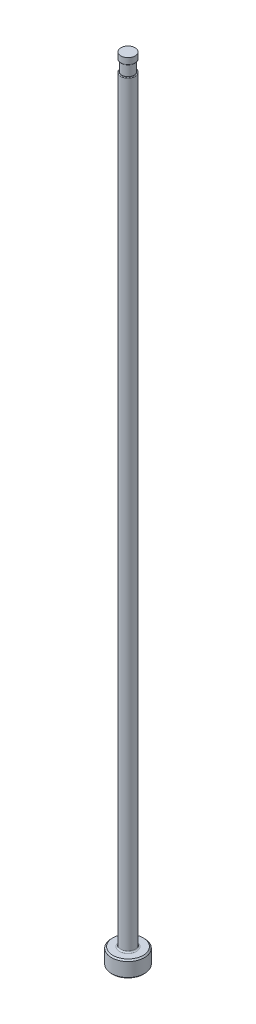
ISO-10303-21;
HEADER;
FILE_DESCRIPTION(('STEP AP214'),'2;1');
FILE_NAME('part.step','',(''),(''),'','','');
FILE_SCHEMA(('AUTOMOTIVE_DESIGN { 1 0 10303 214 1 1 1 1 }'));
ENDSEC;
DATA;
#1=APPLICATION_CONTEXT('core data for automotive mechanical design processes');
#2=APPLICATION_PROTOCOL_DEFINITION('international standard','automotive_design',2000,#1);
#3=PRODUCT_CONTEXT('',#1,'mechanical');
#4=PRODUCT('Part','Part','',(#3));
#5=PRODUCT_RELATED_PRODUCT_CATEGORY('part','',(#4));
#6=PRODUCT_DEFINITION_FORMATION('','',#4);
#7=PRODUCT_DEFINITION_CONTEXT('part definition',#1,'design');
#8=PRODUCT_DEFINITION('design','',#6,#7);
#9=PRODUCT_DEFINITION_SHAPE('','',#8);
#10=(LENGTH_UNIT() NAMED_UNIT(*) SI_UNIT(.MILLI.,.METRE.));
#11=(NAMED_UNIT(*) PLANE_ANGLE_UNIT() SI_UNIT($,.RADIAN.));
#12=(NAMED_UNIT(*) SI_UNIT($,.STERADIAN.) SOLID_ANGLE_UNIT());
#13=UNCERTAINTY_MEASURE_WITH_UNIT(LENGTH_MEASURE(1.E-05),#10,'distance_accuracy_value','');
#14=(GEOMETRIC_REPRESENTATION_CONTEXT(3) GLOBAL_UNCERTAINTY_ASSIGNED_CONTEXT((#13)) GLOBAL_UNIT_ASSIGNED_CONTEXT((#10,
#11,#12)) REPRESENTATION_CONTEXT('',''));
#15=CARTESIAN_POINT('',(0.,0.,0.));
#16=DIRECTION('',(0.,0.,1.));
#17=DIRECTION('',(1.,0.,0.));
#18=AXIS2_PLACEMENT_3D('',#15,#16,#17);
#19=CARTESIAN_POINT('',(-1.38810999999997,151.13,0.));
#20=DIRECTION('',(0.,1.,0.));
#21=DIRECTION('',(0.,0.,1.));
#22=AXIS2_PLACEMENT_3D('',#19,#20,#21);
#23=PLANE('',#22);
#24=CARTESIAN_POINT('',(0.,151.13,0.));
#25=DIRECTION('',(0.,1.,0.));
#26=DIRECTION('',(0.,0.,1.));
#27=AXIS2_PLACEMENT_3D('',#24,#25,#26);
#28=CIRCLE('',#27,1.24840999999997);
#29=CARTESIAN_POINT('',(0.,151.13,1.24840999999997));
#30=VERTEX_POINT('',#29);
#31=EDGE_CURVE('E11',#30,#30,#28,.F.);
#32=ORIENTED_EDGE('',*,*,#31,.T.);
#33=EDGE_LOOP('',(#32));
#34=FACE_BOUND('',#33,.T.);
#35=CARTESIAN_POINT('',(0.,151.13,0.));
#36=DIRECTION('',(0.,1.,0.));
#37=DIRECTION('',(0.,0.,1.));
#38=AXIS2_PLACEMENT_3D('',#35,#36,#37);
#39=CIRCLE('',#38,1.18490999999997);
#40=CARTESIAN_POINT('',(0.,151.13,1.18490999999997));
#41=VERTEX_POINT('',#40);
#42=EDGE_CURVE('E78',#41,#41,#39,.T.);
#43=ORIENTED_EDGE('',*,*,#42,.T.);
#44=EDGE_LOOP('',(#43));
#45=FACE_BOUND('',#44,.T.);
#46=ADVANCED_FACE('F36',(#34,#45),#23,.F.);
#47=CARTESIAN_POINT('',(0.,259.958771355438,0.));
#48=DIRECTION('',(0.,1.,0.));
#49=DIRECTION('',(0.,0.,1.));
#50=AXIS2_PLACEMENT_3D('',#47,#48,#49);
#51=CYLINDRICAL_SURFACE('',#50,1.38810999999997);
#52=DIRECTION('',(0.,1.,0.));
#53=VECTOR('',#52,1.);
#54=CARTESIAN_POINT('',(-1.18490999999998,259.958771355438,-0.723075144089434));
#55=LINE('',#54,#53);
#56=CARTESIAN_POINT('',(-1.18490999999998,148.971,-0.723075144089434));
#57=VERTEX_POINT('',#56);
#58=CARTESIAN_POINT('',(-1.18490999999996,86.614,-0.723075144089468));
#59=VERTEX_POINT('',#58);
#60=EDGE_CURVE('E73',#57,#59,#55,.F.);
#61=ORIENTED_EDGE('',*,*,#60,.F.);
#62=CARTESIAN_POINT('',(0.,148.971,0.));
#63=DIRECTION('',(0.,-1.,0.));
#64=DIRECTION('',(0.,0.,-1.));
#65=AXIS2_PLACEMENT_3D('',#62,#63,#64);
#66=CIRCLE('',#65,1.38810999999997);
#67=CARTESIAN_POINT('',(-1.18490999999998,148.971,0.723075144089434));
#68=VERTEX_POINT('',#67);
#69=EDGE_CURVE('E51',#57,#68,#66,.T.);
#70=ORIENTED_EDGE('',*,*,#69,.T.);
#71=DIRECTION('',(0.,1.,0.));
#72=VECTOR('',#71,1.);
#73=CARTESIAN_POINT('',(-1.18490999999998,259.958771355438,0.723075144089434));
#74=LINE('',#73,#72);
#75=CARTESIAN_POINT('',(-1.18490999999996,86.614,0.723075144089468));
#76=VERTEX_POINT('',#75);
#77=EDGE_CURVE('E84',#76,#68,#74,.T.);
#78=ORIENTED_EDGE('',*,*,#77,.F.);
#79=CARTESIAN_POINT('',(-1.18490999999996,86.614,-0.723075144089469));
#80=CARTESIAN_POINT('',(-1.18490489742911,86.5732205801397,-0.723062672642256));
#81=CARTESIAN_POINT('',(-1.18569554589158,86.5324368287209,-0.721787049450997));
#82=CARTESIAN_POINT('',(-1.18883387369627,86.4510484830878,-0.716617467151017));
#83=CARTESIAN_POINT('',(-1.1911833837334,86.4104441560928,-0.712720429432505));
#84=CARTESIAN_POINT('',(-1.19743938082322,86.3292508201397,-0.702157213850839));
#85=CARTESIAN_POINT('',(-1.20136288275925,86.2886669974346,-0.695460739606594));
#86=CARTESIAN_POINT('',(-1.21067765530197,86.2082938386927,-0.67911480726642));
#87=CARTESIAN_POINT('',(-1.2160681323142,86.1685040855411,-0.669466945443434));
#88=CARTESIAN_POINT('',(-1.23107456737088,86.0713821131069,-0.641613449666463));
#89=CARTESIAN_POINT('',(-1.24148150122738,86.0146925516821,-0.621519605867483));
#90=CARTESIAN_POINT('',(-1.26447851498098,85.9054679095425,-0.573286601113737));
#91=CARTESIAN_POINT('',(-1.27705975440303,85.8529172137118,-0.545179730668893));
#92=CARTESIAN_POINT('',(-1.299036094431,85.7696552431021,-0.48983438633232));
#93=CARTESIAN_POINT('',(-1.30819937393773,85.7372483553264,-0.465065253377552));
#94=CARTESIAN_POINT('',(-1.32626857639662,85.6766429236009,-0.410706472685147));
#95=CARTESIAN_POINT('',(-1.3351748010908,85.6484392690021,-0.381122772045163));
#96=CARTESIAN_POINT('',(-1.35001998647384,85.6032436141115,-0.323985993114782));
#97=CARTESIAN_POINT('',(-1.35618457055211,85.5851455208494,-0.297371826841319));
#98=CARTESIAN_POINT('',(-1.36726162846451,85.553356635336,-0.241365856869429));
#99=CARTESIAN_POINT('',(-1.37217474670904,85.539663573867,-0.21197549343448));
#100=CARTESIAN_POINT('',(-1.38024868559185,85.5174660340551,-0.150740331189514));
#101=CARTESIAN_POINT('',(-1.38339384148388,85.5090078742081,-0.118876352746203));
#102=CARTESIAN_POINT('',(-1.38743875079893,85.4981704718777,-0.0539942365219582));
#103=CARTESIAN_POINT('',(-1.38834050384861,85.4957858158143,-0.0209771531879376));
#104=CARTESIAN_POINT('',(-1.38781595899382,85.4971829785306,0.0402827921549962));
#105=CARTESIAN_POINT('',(-1.38669623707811,85.5001526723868,0.0685504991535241));
#106=CARTESIAN_POINT('',(-1.38282885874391,85.5105312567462,0.124136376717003));
#107=CARTESIAN_POINT('',(-1.38008112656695,85.5179403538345,0.15145450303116));
#108=CARTESIAN_POINT('',(-1.37323772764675,85.536729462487,0.204400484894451));
#109=CARTESIAN_POINT('',(-1.36914590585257,85.5480981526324,0.230032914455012));
#110=CARTESIAN_POINT('',(-1.35995546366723,85.5742451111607,0.279283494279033));
#111=CARTESIAN_POINT('',(-1.35485642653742,85.5890247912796,0.302900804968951));
#112=CARTESIAN_POINT('',(-1.34133825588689,85.6293722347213,0.358961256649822));
#113=CARTESIAN_POINT('',(-1.33251649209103,85.6566776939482,0.390059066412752));
#114=CARTESIAN_POINT('',(-1.31441262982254,85.7159257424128,0.447296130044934));
#115=CARTESIAN_POINT('',(-1.3051296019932,85.747877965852,0.473424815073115));
#116=CARTESIAN_POINT('',(-1.28282911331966,85.8299694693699,0.531562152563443));
#117=CARTESIAN_POINT('',(-1.26997193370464,85.8819111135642,0.561075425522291));
#118=CARTESIAN_POINT('',(-1.24628723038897,85.9902374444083,0.611885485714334));
#119=CARTESIAN_POINT('',(-1.23546851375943,86.0466399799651,0.633147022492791));
#120=CARTESIAN_POINT('',(-1.2193975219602,86.1454407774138,0.663412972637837));
#121=CARTESIAN_POINT('',(-1.21343915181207,86.1872026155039,0.674183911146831));
#122=CARTESIAN_POINT('',(-1.20313242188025,86.2716684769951,0.692410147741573));
#123=CARTESIAN_POINT('',(-1.19878518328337,86.3143731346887,0.699863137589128));
#124=CARTESIAN_POINT('',(-1.19185743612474,86.3998039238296,0.711598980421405));
#125=CARTESIAN_POINT('',(-1.18925556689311,86.4425231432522,0.715920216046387));
#126=CARTESIAN_POINT('',(-1.18577996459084,86.5281637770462,0.721648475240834));
#127=CARTESIAN_POINT('',(-1.18490366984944,86.5710847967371,0.723059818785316));
#128=CARTESIAN_POINT('',(-1.18490999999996,86.614,0.723075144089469));
#129=B_SPLINE_CURVE_WITH_KNOTS('',3,(#79,#80,#81,#82,#83,#84,#85,#86,#87,#88,#89,#90,#91,#92,
#93,#94,#95,#96,#97,#98,#99,#100,#101,#102,#103,#104,#105,#106,#107,#108,#109,#110,#111,#112,
#113,#114,#115,#116,#117,#118,#119,#120,#121,#122,#123,#124,#125,#126,#127,#128),.UNSPECIFIED.,
.F.,.F.,(4,2,2,2,2,2,2,2,2,2,2,2,2,2,2,2,2,2,2,2,2,2,2,2,4),(0.,0.122317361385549,
0.244778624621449,0.368600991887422,0.492356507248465,0.674882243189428,0.856682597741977,
0.981714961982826,1.10659403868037,1.20453097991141,1.30241738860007,1.40115795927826,
1.49981048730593,1.58473133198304,1.66965612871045,1.75434007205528,1.83905912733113,
1.96528739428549,2.09178120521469,2.27410969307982,2.45720871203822,2.58766049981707,
2.71820289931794,2.84711699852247,2.97583957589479),.UNSPECIFIED.);
#130=EDGE_CURVE('E81',#59,#76,#129,.T.);
#131=ORIENTED_EDGE('',*,*,#130,.F.);
#132=EDGE_LOOP('',(#61,#70,#78,#131));
#133=FACE_BOUND('',#132,.T.);
#134=CARTESIAN_POINT('',(0.,3.42900000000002,0.));
#135=DIRECTION('',(0.,1.,0.));
#136=DIRECTION('',(0.,0.,1.));
#137=AXIS2_PLACEMENT_3D('',#134,#135,#136);
#138=CIRCLE('',#137,1.38810999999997);
#139=CARTESIAN_POINT('',(0.,3.42900000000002,1.38810999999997));
#140=VERTEX_POINT('',#139);
#141=EDGE_CURVE('E116',#140,#140,#138,.T.);
#142=ORIENTED_EDGE('',*,*,#141,.T.);
#143=EDGE_LOOP('',(#142));
#144=FACE_BOUND('',#143,.T.);
#145=ADVANCED_FACE('F82',(#133,#144),#51,.T.);
#146=CARTESIAN_POINT('',(0.,0.,0.));
#147=DIRECTION('',(0.,-1.,0.));
#148=DIRECTION('',(0.,0.,-1.));
#149=AXIS2_PLACEMENT_3D('',#146,#147,#148);
#150=PLANE('',#149);
#151=CARTESIAN_POINT('',(0.,0.,0.));
#152=DIRECTION('',(0.,-1.,0.));
#153=DIRECTION('',(0.,0.,-1.));
#154=AXIS2_PLACEMENT_3D('',#151,#152,#153);
#155=CIRCLE('',#154,2.92099999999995);
#156=CARTESIAN_POINT('',(0.,0.,-2.92099999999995));
#157=VERTEX_POINT('',#156);
#158=EDGE_CURVE('E113',#157,#157,#155,.T.);
#159=ORIENTED_EDGE('',*,*,#158,.T.);
#160=EDGE_LOOP('',(#159));
#161=FACE_BOUND('',#160,.T.);
#162=ADVANCED_FACE('F192',(#161),#150,.T.);
#163=CARTESIAN_POINT('',(0.,259.958771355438,0.));
#164=DIRECTION('',(0.,1.,0.));
#165=DIRECTION('',(0.,0.,1.));
#166=AXIS2_PLACEMENT_3D('',#163,#164,#165);
#167=CYLINDRICAL_SURFACE('',#166,3.17499999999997);
#168=CARTESIAN_POINT('',(0.,2.92100000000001,0.));
#169=DIRECTION('',(0.,1.,0.));
#170=DIRECTION('',(0.,0.,1.));
#171=AXIS2_PLACEMENT_3D('',#168,#169,#170);
#172=CIRCLE('',#171,3.17499999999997);
#173=CARTESIAN_POINT('',(0.,2.92100000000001,3.17499999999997));
#174=VERTEX_POINT('',#173);
#175=EDGE_CURVE('E110',#174,#174,#172,.F.);
#176=ORIENTED_EDGE('',*,*,#175,.T.);
#177=EDGE_LOOP('',(#176));
#178=FACE_BOUND('',#177,.T.);
#179=CARTESIAN_POINT('',(0.,0.254000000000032,0.));
#180=DIRECTION('',(0.,-1.,0.));
#181=DIRECTION('',(0.,0.,-1.));
#182=AXIS2_PLACEMENT_3D('',#179,#180,#181);
#183=CIRCLE('',#182,3.17499999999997);
#184=CARTESIAN_POINT('',(0.,0.254000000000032,-3.17499999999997));
#185=VERTEX_POINT('',#184);
#186=EDGE_CURVE('E107',#185,#185,#183,.F.);
#187=ORIENTED_EDGE('',*,*,#186,.T.);
#188=EDGE_LOOP('',(#187));
#189=FACE_BOUND('',#188,.T.);
#190=ADVANCED_FACE('F195',(#178,#189),#167,.T.);
#191=CARTESIAN_POINT('',(-3.17499999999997,3.175,0.));
#192=DIRECTION('',(0.,1.,0.));
#193=DIRECTION('',(0.,0.,1.));
#194=AXIS2_PLACEMENT_3D('',#191,#192,#193);
#195=PLANE('',#194);
#196=CARTESIAN_POINT('',(0.,3.175,0.));
#197=DIRECTION('',(0.,1.,0.));
#198=DIRECTION('',(0.,0.,1.));
#199=AXIS2_PLACEMENT_3D('',#196,#197,#198);
#200=CIRCLE('',#199,1.64210999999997);
#201=CARTESIAN_POINT('',(0.,3.175,1.64210999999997));
#202=VERTEX_POINT('',#201);
#203=EDGE_CURVE('E87',#202,#202,#200,.F.);
#204=ORIENTED_EDGE('',*,*,#203,.T.);
#205=EDGE_LOOP('',(#204));
#206=FACE_BOUND('',#205,.T.);
#207=CARTESIAN_POINT('',(0.,3.175,0.));
#208=DIRECTION('',(0.,1.,0.));
#209=DIRECTION('',(0.,0.,1.));
#210=AXIS2_PLACEMENT_3D('',#207,#208,#209);
#211=CIRCLE('',#210,2.92099999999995);
#212=CARTESIAN_POINT('',(0.,3.175,2.92099999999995));
#213=VERTEX_POINT('',#212);
#214=EDGE_CURVE('E104',#213,#213,#211,.T.);
#215=ORIENTED_EDGE('',*,*,#214,.T.);
#216=EDGE_LOOP('',(#215));
#217=FACE_BOUND('',#216,.T.);
#218=ADVANCED_FACE('F190',(#206,#217),#195,.T.);
#219=CARTESIAN_POINT('',(0.,3.17499999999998,0.));
#220=DIRECTION('',(0.,-1.,0.));
#221=DIRECTION('',(0.,0.,-1.));
#222=AXIS2_PLACEMENT_3D('',#219,#220,#221);
#223=CONICAL_SURFACE('',#222,2.92099999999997,0.7853981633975);
#224=ORIENTED_EDGE('',*,*,#175,.F.);
#225=EDGE_LOOP('',(#224));
#226=FACE_BOUND('',#225,.T.);
#227=ORIENTED_EDGE('',*,*,#214,.F.);
#228=EDGE_LOOP('',(#227));
#229=FACE_BOUND('',#228,.T.);
#230=ADVANCED_FACE('F186',(#226,#229),#223,.T.);
#231=CARTESIAN_POINT('',(0.,0.254000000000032,0.));
#232=DIRECTION('',(0.,1.,0.));
#233=DIRECTION('',(0.,0.,1.));
#234=AXIS2_PLACEMENT_3D('',#231,#232,#233);
#235=CONICAL_SURFACE('',#234,3.17499999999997,0.785398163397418);
#236=ORIENTED_EDGE('',*,*,#158,.F.);
#237=EDGE_LOOP('',(#236));
#238=FACE_BOUND('',#237,.T.);
#239=ORIENTED_EDGE('',*,*,#186,.F.);
#240=EDGE_LOOP('',(#239));
#241=FACE_BOUND('',#240,.T.);
#242=ADVANCED_FACE('F182',(#238,#241),#235,.T.);
#243=CARTESIAN_POINT('',(0.,3.42900000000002,0.));
#244=DIRECTION('',(0.,1.,0.));
#245=DIRECTION('',(0.,0.,1.));
#246=AXIS2_PLACEMENT_3D('',#243,#244,#245);
#247=TOROIDAL_SURFACE('',#246,1.64210999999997,0.254);
#248=ORIENTED_EDGE('',*,*,#203,.F.);
#249=EDGE_LOOP('',(#248));
#250=FACE_BOUND('',#249,.T.);
#251=ORIENTED_EDGE('',*,*,#141,.F.);
#252=EDGE_LOOP('',(#251));
#253=FACE_BOUND('',#252,.T.);
#254=ADVANCED_FACE('F147',(#250,#253),#247,.F.);
#255=CARTESIAN_POINT('',(-1.38810999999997,149.098,0.));
#256=DIRECTION('',(0.,-1.,0.));
#257=DIRECTION('',(0.,0.,-1.));
#258=AXIS2_PLACEMENT_3D('',#255,#256,#257);
#259=PLANE('',#258);
#260=DIRECTION('',(0.,0.,1.));
#261=VECTOR('',#260,1.);
#262=CARTESIAN_POINT('',(-1.18490999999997,149.098,0.));
#263=LINE('',#262,#261);
#264=CARTESIAN_POINT('',(-1.18490999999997,149.098,0.));
#265=VERTEX_POINT('',#264);
#266=CARTESIAN_POINT('',(-1.18490999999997,149.098,0.431725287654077));
#267=VERTEX_POINT('',#266);
#268=EDGE_CURVE('E90',#265,#267,#263,.T.);
#269=ORIENTED_EDGE('',*,*,#268,.T.);
#270=CARTESIAN_POINT('',(0.,149.098,0.));
#271=DIRECTION('',(0.,-1.,0.));
#272=DIRECTION('',(0.,0.,-1.));
#273=AXIS2_PLACEMENT_3D('',#270,#271,#272);
#274=CIRCLE('',#273,1.26110999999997);
#275=CARTESIAN_POINT('',(-1.18490999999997,149.098,-0.431725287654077));
#276=VERTEX_POINT('',#275);
#277=EDGE_CURVE('E86',#267,#276,#274,.F.);
#278=ORIENTED_EDGE('',*,*,#277,.T.);
#279=EDGE_CURVE('E79',#276,#265,#263,.T.);
#280=ORIENTED_EDGE('',*,*,#279,.T.);
#281=CARTESIAN_POINT('',(0.,149.098,0.));
#282=DIRECTION('',(0.,1.,0.));
#283=DIRECTION('',(0.,0.,1.));
#284=AXIS2_PLACEMENT_3D('',#281,#282,#283);
#285=CIRCLE('',#284,1.18490999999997);
#286=EDGE_CURVE('E101',#265,#265,#285,.T.);
#287=ORIENTED_EDGE('',*,*,#286,.F.);
#288=EDGE_LOOP('',(#269,#278,#280,#287));
#289=FACE_BOUND('',#288,.T.);
#290=ADVANCED_FACE('F144',(#289),#259,.F.);
#291=CARTESIAN_POINT('',(0.,153.448281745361,0.));
#292=DIRECTION('',(0.,1.,0.));
#293=DIRECTION('',(0.,0.,1.));
#294=AXIS2_PLACEMENT_3D('',#291,#292,#293);
#295=CYLINDRICAL_SURFACE('',#294,1.18490999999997);
#296=ORIENTED_EDGE('',*,*,#42,.F.);
#297=EDGE_LOOP('',(#296));
#298=FACE_BOUND('',#297,.T.);
#299=ORIENTED_EDGE('',*,*,#286,.T.);
#300=EDGE_LOOP('',(#299));
#301=FACE_BOUND('',#300,.T.);
#302=ADVANCED_FACE('F141',(#298,#301),#295,.T.);
#303=CARTESIAN_POINT('',(-1.18490999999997,150.114,-3.17499999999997));
#304=DIRECTION('',(1.,0.,0.));
#305=DIRECTION('',(0.,1.,0.));
#306=AXIS2_PLACEMENT_3D('',#303,#304,#305);
#307=PLANE('',#306);
#308=ORIENTED_EDGE('',*,*,#279,.F.);
#309=CARTESIAN_POINT('',(-1.18490999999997,149.098,-0.431725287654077));
#310=CARTESIAN_POINT('',(-1.18490999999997,149.097996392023,-0.443927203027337));
#311=CARTESIAN_POINT('',(-1.18490999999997,149.097793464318,-0.456134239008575));
#312=CARTESIAN_POINT('',(-1.18490999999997,149.096871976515,-0.48055975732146));
#313=CARTESIAN_POINT('',(-1.18490999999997,149.096152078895,-0.492778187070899));
#314=CARTESIAN_POINT('',(-1.18490999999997,149.094068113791,-0.517285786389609));
#315=CARTESIAN_POINT('',(-1.18490999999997,149.092697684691,-0.529574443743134));
#316=CARTESIAN_POINT('',(-1.18490999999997,149.089154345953,-0.554026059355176));
#317=CARTESIAN_POINT('',(-1.18490999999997,149.086982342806,-0.566189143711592));
#318=CARTESIAN_POINT('',(-1.18490999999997,149.08185310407,-0.589290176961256));
#319=CARTESIAN_POINT('',(-1.18490999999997,149.078976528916,-0.600245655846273));
#320=CARTESIAN_POINT('',(-1.18490999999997,149.072158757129,-0.621829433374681));
#321=CARTESIAN_POINT('',(-1.18490999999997,149.06821796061,-0.632457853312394));
#322=CARTESIAN_POINT('',(-1.18490999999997,149.059651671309,-0.651596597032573));
#323=CARTESIAN_POINT('',(-1.18490999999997,149.055211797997,-0.660188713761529));
#324=CARTESIAN_POINT('',(-1.18490999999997,149.045086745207,-0.676609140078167));
#325=CARTESIAN_POINT('',(-1.18490999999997,149.039405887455,-0.684439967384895));
#326=CARTESIAN_POINT('',(-1.18490999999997,149.029548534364,-0.695366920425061));
#327=CARTESIAN_POINT('',(-1.18490999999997,149.025921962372,-0.698957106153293));
#328=CARTESIAN_POINT('',(-1.18490999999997,149.018202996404,-0.705604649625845));
#329=CARTESIAN_POINT('',(-1.18490999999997,149.014110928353,-0.708662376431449));
#330=CARTESIAN_POINT('',(-1.18490999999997,149.006145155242,-0.713626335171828));
#331=CARTESIAN_POINT('',(-1.18490999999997,149.002337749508,-0.715637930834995));
#332=CARTESIAN_POINT('',(-1.18490999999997,148.994445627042,-0.719002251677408));
#333=CARTESIAN_POINT('',(-1.18490999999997,148.990361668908,-0.720356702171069));
#334=CARTESIAN_POINT('',(-1.18490999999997,148.983704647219,-0.721899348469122));
#335=CARTESIAN_POINT('',(-1.18490999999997,148.98118800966,-0.722337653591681));
#336=CARTESIAN_POINT('',(-1.18490999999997,148.976115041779,-0.722926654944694));
#337=CARTESIAN_POINT('',(-1.18490999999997,148.97355862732,-0.723076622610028));
#338=CARTESIAN_POINT('',(-1.18490999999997,148.971000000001,-0.723075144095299));
#339=B_SPLINE_CURVE_WITH_KNOTS('',3,(#309,#310,#311,#312,#313,#314,#315,#316,#317,#318,#319,
#320,#321,#322,#323,#324,#325,#326,#327,#328,#329,#330,#331,#332,#333,#334,#335,#336,#337,#338),
.UNSPECIFIED.,.F.,.F.,(4,2,2,2,2,2,2,2,2,2,2,2,2,2,4),(0.,0.0366119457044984,0.0733189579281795,
0.110392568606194,0.14742438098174,0.181365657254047,0.215294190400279,0.244238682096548,
0.273083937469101,0.288356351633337,0.303618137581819,0.316487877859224,0.329323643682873,
0.336971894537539,0.344639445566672),.UNSPECIFIED.);
#340=EDGE_CURVE('E59',#276,#57,#339,.T.);
#341=ORIENTED_EDGE('',*,*,#340,.T.);
#342=ORIENTED_EDGE('',*,*,#60,.T.);
#343=DIRECTION('',(0.,0.,1.));
#344=VECTOR('',#343,1.);
#345=CARTESIAN_POINT('',(-1.18490999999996,86.614,-3.17499999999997));
#346=LINE('',#345,#344);
#347=EDGE_CURVE('E77',#59,#76,#346,.T.);
#348=ORIENTED_EDGE('',*,*,#347,.T.);
#349=ORIENTED_EDGE('',*,*,#77,.T.);
#350=CARTESIAN_POINT('',(-1.18490999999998,148.971,0.723075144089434));
#351=CARTESIAN_POINT('',(-1.18490999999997,148.974961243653,0.723084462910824));
#352=CARTESIAN_POINT('',(-1.18490999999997,148.978912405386,0.722719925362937));
#353=CARTESIAN_POINT('',(-1.18490999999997,148.986661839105,0.721324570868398));
#354=CARTESIAN_POINT('',(-1.18490999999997,148.990461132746,0.720299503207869));
#355=CARTESIAN_POINT('',(-1.18490999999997,148.997834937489,0.717665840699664));
#356=CARTESIAN_POINT('',(-1.18490999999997,149.001410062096,0.716058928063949));
#357=CARTESIAN_POINT('',(-1.18490999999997,149.008307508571,0.712363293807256));
#358=CARTESIAN_POINT('',(-1.18490999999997,149.011629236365,0.710273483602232));
#359=CARTESIAN_POINT('',(-1.18490999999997,149.020123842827,0.70418693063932));
#360=CARTESIAN_POINT('',(-1.18490999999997,149.025051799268,0.699848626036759));
#361=CARTESIAN_POINT('',(-1.18490999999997,149.034179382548,0.690466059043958));
#362=CARTESIAN_POINT('',(-1.18490999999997,149.038376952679,0.685419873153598));
#363=CARTESIAN_POINT('',(-1.18490999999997,149.048925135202,0.671062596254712));
#364=CARTESIAN_POINT('',(-1.18490999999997,149.05465072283,0.661296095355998));
#365=CARTESIAN_POINT('',(-1.18490999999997,149.06464686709,0.641058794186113));
#366=CARTESIAN_POINT('',(-1.18490999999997,149.068913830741,0.630586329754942));
#367=CARTESIAN_POINT('',(-1.18490999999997,149.080249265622,0.597997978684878));
#368=CARTESIAN_POINT('',(-1.18490999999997,149.085516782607,0.575266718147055));
#369=CARTESIAN_POINT('',(-1.18490999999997,149.093081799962,0.529347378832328));
#370=CARTESIAN_POINT('',(-1.18490999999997,149.095370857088,0.50615818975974));
#371=CARTESIAN_POINT('',(-1.18490999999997,149.097127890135,0.474376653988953));
#372=CARTESIAN_POINT('',(-1.18490999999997,149.097464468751,0.465824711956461));
#373=CARTESIAN_POINT('',(-1.18490999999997,149.097899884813,0.448756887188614));
#374=CARTESIAN_POINT('',(-1.18490999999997,149.097999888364,0.440241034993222));
#375=CARTESIAN_POINT('',(-1.18490999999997,149.098,0.431725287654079));
#376=B_SPLINE_CURVE_WITH_KNOTS('',3,(#350,#351,#352,#353,#354,#355,#356,#357,#358,#359,#360,
#361,#362,#363,#364,#365,#366,#367,#368,#369,#370,#371,#372,#373,#374,#375),.UNSPECIFIED.,.F.,
.F.,(4,2,2,2,2,2,2,2,2,2,2,2,4),(0.,0.0118509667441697,0.0236001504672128,0.0353156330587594,
0.0470577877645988,0.0666403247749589,0.0862771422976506,0.120048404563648,0.153902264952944,
0.223511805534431,0.293318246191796,0.318991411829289,0.344537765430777),.UNSPECIFIED.);
#377=EDGE_CURVE('E172',#68,#267,#376,.T.);
#378=ORIENTED_EDGE('',*,*,#377,.T.);
#379=ORIENTED_EDGE('',*,*,#268,.F.);
#380=EDGE_LOOP('',(#308,#341,#342,#348,#349,#378,#379));
#381=FACE_BOUND('',#380,.T.);
#382=ADVANCED_FACE('F75',(#381),#307,.F.);
#383=CARTESIAN_POINT('',(-4.35990999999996,86.614,-3.17499999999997));
#384=DIRECTION('',(0.,0.,1.));
#385=DIRECTION('',(1.,0.,0.));
#386=AXIS2_PLACEMENT_3D('',#383,#384,#385);
#387=CYLINDRICAL_SURFACE('',#386,3.175);
#388=ORIENTED_EDGE('',*,*,#347,.F.);
#389=ORIENTED_EDGE('',*,*,#130,.T.);
#390=EDGE_LOOP('',(#388,#389));
#391=FACE_BOUND('',#390,.T.);
#392=ADVANCED_FACE('F89',(#391),#387,.F.);
#393=CARTESIAN_POINT('',(0.,152.687735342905,0.));
#394=DIRECTION('',(0.,1.,0.));
#395=DIRECTION('',(0.,0.,1.));
#396=AXIS2_PLACEMENT_3D('',#393,#394,#395);
#397=CYLINDRICAL_SURFACE('',#396,1.37540999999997);
#398=CARTESIAN_POINT('',(0.,151.257,0.));
#399=DIRECTION('',(0.,1.,0.));
#400=DIRECTION('',(0.,0.,1.));
#401=AXIS2_PLACEMENT_3D('',#398,#399,#400);
#402=CIRCLE('',#401,1.37540999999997);
#403=CARTESIAN_POINT('',(0.,151.257,1.37540999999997));
#404=VERTEX_POINT('',#403);
#405=EDGE_CURVE('E44',#404,#404,#402,.T.);
#406=ORIENTED_EDGE('',*,*,#405,.T.);
#407=EDGE_LOOP('',(#406));
#408=FACE_BOUND('',#407,.T.);
#409=CARTESIAN_POINT('',(0.,152.4,0.));
#410=DIRECTION('',(0.,1.,0.));
#411=DIRECTION('',(0.,0.,1.));
#412=AXIS2_PLACEMENT_3D('',#409,#410,#411);
#413=CIRCLE('',#412,1.37540999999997);
#414=CARTESIAN_POINT('',(0.,152.4,1.37540999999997));
#415=VERTEX_POINT('',#414);
#416=EDGE_CURVE('E91',#415,#415,#413,.T.);
#417=ORIENTED_EDGE('',*,*,#416,.F.);
#418=EDGE_LOOP('',(#417));
#419=FACE_BOUND('',#418,.T.);
#420=ADVANCED_FACE('F135',(#408,#419),#397,.T.);
#421=CARTESIAN_POINT('',(-1.38810999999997,152.4,0.));
#422=DIRECTION('',(0.,1.,0.));
#423=DIRECTION('',(0.,0.,1.));
#424=AXIS2_PLACEMENT_3D('',#421,#422,#423);
#425=PLANE('',#424);
#426=ORIENTED_EDGE('',*,*,#416,.T.);
#427=EDGE_LOOP('',(#426));
#428=FACE_BOUND('',#427,.T.);
#429=ADVANCED_FACE('F149',(#428),#425,.T.);
#430=CARTESIAN_POINT('',(0.,148.971,0.));
#431=DIRECTION('',(0.,-1.,0.));
#432=DIRECTION('',(0.,0.,-1.));
#433=AXIS2_PLACEMENT_3D('',#430,#431,#432);
#434=TOROIDAL_SURFACE('',#433,1.26110999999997,0.127);
#435=ORIENTED_EDGE('',*,*,#377,.F.);
#436=ORIENTED_EDGE('',*,*,#69,.F.);
#437=ORIENTED_EDGE('',*,*,#340,.F.);
#438=ORIENTED_EDGE('',*,*,#277,.F.);
#439=EDGE_LOOP('',(#435,#436,#437,#438));
#440=FACE_BOUND('',#439,.T.);
#441=ADVANCED_FACE('F151',(#440),#434,.T.);
#442=CARTESIAN_POINT('',(0.,151.257,0.));
#443=DIRECTION('',(0.,1.,0.));
#444=DIRECTION('',(0.,0.,1.));
#445=AXIS2_PLACEMENT_3D('',#442,#443,#444);
#446=TOROIDAL_SURFACE('',#445,1.24840999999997,0.127);
#447=ORIENTED_EDGE('',*,*,#31,.F.);
#448=EDGE_LOOP('',(#447));
#449=FACE_BOUND('',#448,.T.);
#450=ORIENTED_EDGE('',*,*,#405,.F.);
#451=EDGE_LOOP('',(#450));
#452=FACE_BOUND('',#451,.T.);
#453=ADVANCED_FACE('F38',(#449,#452),#446,.T.);
#454=CLOSED_SHELL('',(#46,#145,#162,#190,#218,#230,#242,#254,#290,#302,#382,#392,#420,#429,#441,#453));
#455=MANIFOLD_SOLID_BREP('B2',#454);
#456=ADVANCED_BREP_SHAPE_REPRESENTATION('',(#18,#455),#14);
#457=SHAPE_DEFINITION_REPRESENTATION(#9,#456);
ENDSEC;
END-ISO-10303-21;
